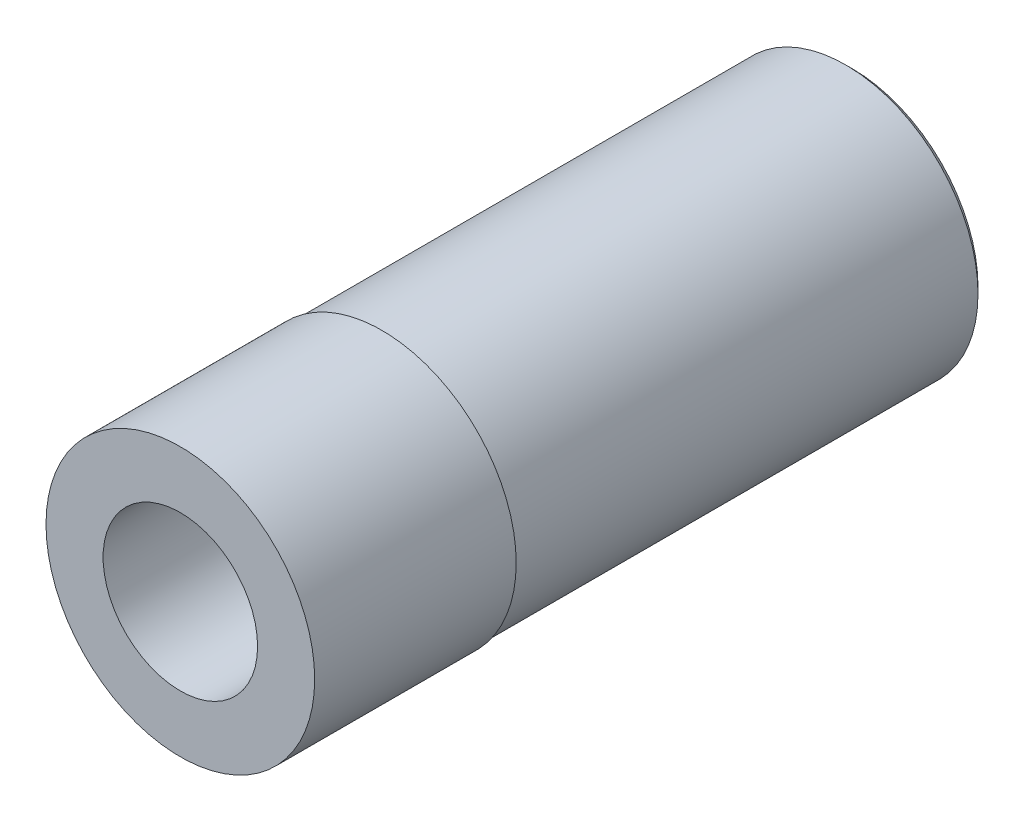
ISO-10303-21;
HEADER;
FILE_DESCRIPTION(('STEP AP214'),'2;1');
FILE_NAME('part.step','',(''),(''),'','','');
FILE_SCHEMA(('AUTOMOTIVE_DESIGN { 1 0 10303 214 1 1 1 1 }'));
ENDSEC;
DATA;
#1=APPLICATION_CONTEXT('core data for automotive mechanical design processes');
#2=APPLICATION_PROTOCOL_DEFINITION('international standard','automotive_design',2000,#1);
#3=PRODUCT_CONTEXT('',#1,'mechanical');
#4=PRODUCT('Part','Part','',(#3));
#5=PRODUCT_RELATED_PRODUCT_CATEGORY('part','',(#4));
#6=PRODUCT_DEFINITION_FORMATION('','',#4);
#7=PRODUCT_DEFINITION_CONTEXT('part definition',#1,'design');
#8=PRODUCT_DEFINITION('design','',#6,#7);
#9=PRODUCT_DEFINITION_SHAPE('','',#8);
#10=(LENGTH_UNIT() NAMED_UNIT(*) SI_UNIT(.MILLI.,.METRE.));
#11=(NAMED_UNIT(*) PLANE_ANGLE_UNIT() SI_UNIT($,.RADIAN.));
#12=(NAMED_UNIT(*) SI_UNIT($,.STERADIAN.) SOLID_ANGLE_UNIT());
#13=UNCERTAINTY_MEASURE_WITH_UNIT(LENGTH_MEASURE(1.E-05),#10,'distance_accuracy_value','');
#14=(GEOMETRIC_REPRESENTATION_CONTEXT(3) GLOBAL_UNCERTAINTY_ASSIGNED_CONTEXT((#13)) GLOBAL_UNIT_ASSIGNED_CONTEXT((#10,
#11,#12)) REPRESENTATION_CONTEXT('',''));
#15=CARTESIAN_POINT('',(0.,0.,0.));
#16=DIRECTION('',(0.,0.,1.));
#17=DIRECTION('',(1.,0.,0.));
#18=AXIS2_PLACEMENT_3D('',#15,#16,#17);
#19=CARTESIAN_POINT('',(0.,0.,3.79790950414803));
#20=DIRECTION('',(0.,0.,1.));
#21=DIRECTION('',(1.,0.,0.));
#22=AXIS2_PLACEMENT_3D('',#19,#20,#21);
#23=CYLINDRICAL_SURFACE('',#22,1.25);
#24=CARTESIAN_POINT('',(0.,0.,-16.));
#25=DIRECTION('',(0.,0.,1.));
#26=DIRECTION('',(1.,0.,0.));
#27=AXIS2_PLACEMENT_3D('',#24,#25,#26);
#28=CIRCLE('',#27,1.25);
#29=CARTESIAN_POINT('',(1.25,0.,-16.));
#30=VERTEX_POINT('',#29);
#31=EDGE_CURVE('E185',#30,#30,#28,.T.);
#32=ORIENTED_EDGE('',*,*,#31,.F.);
#33=EDGE_LOOP('',(#32));
#34=FACE_BOUND('',#33,.T.);
#35=CARTESIAN_POINT('',(0.,0.,-6.));
#36=DIRECTION('',(0.,0.,1.));
#37=DIRECTION('',(1.,0.,0.));
#38=AXIS2_PLACEMENT_3D('',#35,#36,#37);
#39=CIRCLE('',#38,1.25);
#40=CARTESIAN_POINT('',(1.08253175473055,-0.624999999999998,-6.));
#41=VERTEX_POINT('',#40);
#42=CARTESIAN_POINT('',(0.,-1.25,-6.));
#43=VERTEX_POINT('',#42);
#44=EDGE_CURVE('E11',#41,#43,#39,.F.);
#45=ORIENTED_EDGE('',*,*,#44,.F.);
#46=CARTESIAN_POINT('',(1.08253175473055,0.625,-6.));
#47=VERTEX_POINT('',#46);
#48=EDGE_CURVE('E38',#47,#41,#39,.F.);
#49=ORIENTED_EDGE('',*,*,#48,.F.);
#50=CARTESIAN_POINT('',(0.,1.25,-6.));
#51=VERTEX_POINT('',#50);
#52=EDGE_CURVE('E111',#51,#47,#39,.F.);
#53=ORIENTED_EDGE('',*,*,#52,.F.);
#54=CARTESIAN_POINT('',(-1.08253175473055,0.624999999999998,-6.));
#55=VERTEX_POINT('',#54);
#56=EDGE_CURVE('E296',#55,#51,#39,.F.);
#57=ORIENTED_EDGE('',*,*,#56,.F.);
#58=CARTESIAN_POINT('',(-1.08253175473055,-0.624999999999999,-6.));
#59=VERTEX_POINT('',#58);
#60=EDGE_CURVE('E294',#59,#55,#39,.F.);
#61=ORIENTED_EDGE('',*,*,#60,.F.);
#62=EDGE_CURVE('E43',#43,#59,#39,.F.);
#63=ORIENTED_EDGE('',*,*,#62,.F.);
#64=EDGE_LOOP('',(#45,#49,#53,#57,#61,#63));
#65=FACE_BOUND('',#64,.T.);
#66=ADVANCED_FACE('F34',(#34,#65),#23,.F.);
#67=CARTESIAN_POINT('',(0.,0.,3.79790950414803));
#68=DIRECTION('',(0.,0.,1.));
#69=DIRECTION('',(1.,0.,0.));
#70=AXIS2_PLACEMENT_3D('',#67,#68,#69);
#71=CYLINDRICAL_SURFACE('',#70,4.);
#72=CARTESIAN_POINT('',(0.,0.,0.));
#73=DIRECTION('',(0.,0.,1.));
#74=DIRECTION('',(1.,0.,0.));
#75=AXIS2_PLACEMENT_3D('',#72,#73,#74);
#76=CIRCLE('',#75,4.);
#77=CARTESIAN_POINT('',(4.,0.,0.));
#78=VERTEX_POINT('',#77);
#79=EDGE_CURVE('E194',#78,#78,#76,.T.);
#80=ORIENTED_EDGE('',*,*,#79,.F.);
#81=EDGE_LOOP('',(#80));
#82=FACE_BOUND('',#81,.T.);
#83=CARTESIAN_POINT('',(0.,0.,-6.));
#84=DIRECTION('',(0.,0.,-1.));
#85=DIRECTION('',(-1.,0.,0.));
#86=AXIS2_PLACEMENT_3D('',#83,#84,#85);
#87=CIRCLE('',#86,4.);
#88=CARTESIAN_POINT('',(-4.,0.,-6.));
#89=VERTEX_POINT('',#88);
#90=EDGE_CURVE('E179',#89,#89,#87,.T.);
#91=ORIENTED_EDGE('',*,*,#90,.F.);
#92=EDGE_LOOP('',(#91));
#93=FACE_BOUND('',#92,.T.);
#94=ADVANCED_FACE('F36',(#82,#93),#71,.T.);
#95=CARTESIAN_POINT('',(0.,0.,-20.));
#96=DIRECTION('',(0.,0.,1.));
#97=DIRECTION('',(1.,0.,0.));
#98=AXIS2_PLACEMENT_3D('',#95,#96,#97);
#99=CONICAL_SURFACE('',#98,3.7499999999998,0.785398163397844);
#100=CARTESIAN_POINT('',(0.,0.,-20.));
#101=DIRECTION('',(0.,0.,1.));
#102=DIRECTION('',(1.,0.,0.));
#103=AXIS2_PLACEMENT_3D('',#100,#101,#102);
#104=CIRCLE('',#103,3.7499999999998);
#105=CARTESIAN_POINT('',(3.7499999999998,0.,-20.));
#106=VERTEX_POINT('',#105);
#107=EDGE_CURVE('E175',#106,#106,#104,.T.);
#108=ORIENTED_EDGE('',*,*,#107,.T.);
#109=EDGE_LOOP('',(#108));
#110=FACE_BOUND('',#109,.T.);
#111=CARTESIAN_POINT('',(0.,0.,-19.815));
#112=DIRECTION('',(0.,0.,1.));
#113=DIRECTION('',(1.,0.,0.));
#114=AXIS2_PLACEMENT_3D('',#111,#112,#113);
#115=CIRCLE('',#114,3.935);
#116=CARTESIAN_POINT('',(3.935,0.,-19.815));
#117=VERTEX_POINT('',#116);
#118=EDGE_CURVE('E174',#117,#117,#115,.T.);
#119=ORIENTED_EDGE('',*,*,#118,.F.);
#120=EDGE_LOOP('',(#119));
#121=FACE_BOUND('',#120,.T.);
#122=ADVANCED_FACE('F204',(#110,#121),#99,.T.);
#123=CARTESIAN_POINT('',(0.,4.,0.));
#124=DIRECTION('',(0.,0.,-1.));
#125=DIRECTION('',(-1.,0.,0.));
#126=AXIS2_PLACEMENT_3D('',#123,#124,#125);
#127=PLANE('',#126);
#128=CARTESIAN_POINT('',(0.,0.,0.));
#129=DIRECTION('',(0.,0.,1.));
#130=DIRECTION('',(1.,0.,0.));
#131=AXIS2_PLACEMENT_3D('',#128,#129,#130);
#132=CIRCLE('',#131,2.3);
#133=CARTESIAN_POINT('',(2.3,0.,0.));
#134=VERTEX_POINT('',#133);
#135=EDGE_CURVE('E191',#134,#134,#132,.T.);
#136=ORIENTED_EDGE('',*,*,#135,.F.);
#137=EDGE_LOOP('',(#136));
#138=FACE_BOUND('',#137,.T.);
#139=ORIENTED_EDGE('',*,*,#79,.T.);
#140=EDGE_LOOP('',(#139));
#141=FACE_BOUND('',#140,.T.);
#142=ADVANCED_FACE('F210',(#138,#141),#127,.F.);
#143=CARTESIAN_POINT('',(0.,0.,3.79790950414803));
#144=DIRECTION('',(0.,0.,1.));
#145=DIRECTION('',(1.,0.,0.));
#146=AXIS2_PLACEMENT_3D('',#143,#144,#145);
#147=CYLINDRICAL_SURFACE('',#146,2.3);
#148=CARTESIAN_POINT('',(0.,0.,-4.));
#149=DIRECTION('',(0.,0.,1.));
#150=DIRECTION('',(1.,0.,0.));
#151=AXIS2_PLACEMENT_3D('',#148,#149,#150);
#152=CIRCLE('',#151,2.3);
#153=CARTESIAN_POINT('',(2.3,0.,-4.));
#154=VERTEX_POINT('',#153);
#155=EDGE_CURVE('E188',#154,#154,#152,.T.);
#156=ORIENTED_EDGE('',*,*,#155,.F.);
#157=EDGE_LOOP('',(#156));
#158=FACE_BOUND('',#157,.T.);
#159=ORIENTED_EDGE('',*,*,#135,.T.);
#160=EDGE_LOOP('',(#159));
#161=FACE_BOUND('',#160,.T.);
#162=ADVANCED_FACE('F218',(#158,#161),#147,.F.);
#163=CARTESIAN_POINT('',(0.,2.3,-4.));
#164=DIRECTION('',(0.,0.,-1.));
#165=DIRECTION('',(-1.,0.,0.));
#166=AXIS2_PLACEMENT_3D('',#163,#164,#165);
#167=PLANE('',#166);
#168=DIRECTION('',(-1.,0.,0.));
#169=VECTOR('',#168,1.);
#170=CARTESIAN_POINT('',(0.721687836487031,1.25,-4.));
#171=LINE('',#170,#169);
#172=CARTESIAN_POINT('',(0.721687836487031,1.25,-4.));
#173=VERTEX_POINT('',#172);
#174=CARTESIAN_POINT('',(-0.721687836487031,1.25,-4.));
#175=VERTEX_POINT('',#174);
#176=EDGE_CURVE('E50',#173,#175,#171,.T.);
#177=ORIENTED_EDGE('',*,*,#176,.F.);
#178=DIRECTION('',(-0.5,0.866025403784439,0.));
#179=VECTOR('',#178,1.);
#180=CARTESIAN_POINT('',(1.44337567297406,0.,-4.));
#181=LINE('',#180,#179);
#182=CARTESIAN_POINT('',(1.44337567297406,0.,-4.));
#183=VERTEX_POINT('',#182);
#184=EDGE_CURVE('E120',#183,#173,#181,.T.);
#185=ORIENTED_EDGE('',*,*,#184,.F.);
#186=DIRECTION('',(0.5,0.866025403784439,0.));
#187=VECTOR('',#186,1.);
#188=CARTESIAN_POINT('',(0.721687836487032,-1.25,-4.));
#189=LINE('',#188,#187);
#190=CARTESIAN_POINT('',(0.721687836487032,-1.25,-4.));
#191=VERTEX_POINT('',#190);
#192=EDGE_CURVE('E114',#191,#183,#189,.T.);
#193=ORIENTED_EDGE('',*,*,#192,.F.);
#194=DIRECTION('',(1.,0.,0.));
#195=VECTOR('',#194,1.);
#196=CARTESIAN_POINT('',(-0.72168783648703,-1.25,-4.));
#197=LINE('',#196,#195);
#198=CARTESIAN_POINT('',(-0.72168783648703,-1.25,-4.));
#199=VERTEX_POINT('',#198);
#200=EDGE_CURVE('E154',#199,#191,#197,.T.);
#201=ORIENTED_EDGE('',*,*,#200,.F.);
#202=DIRECTION('',(0.5,-0.866025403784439,0.));
#203=VECTOR('',#202,1.);
#204=CARTESIAN_POINT('',(-1.44337567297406,0.,-4.));
#205=LINE('',#204,#203);
#206=CARTESIAN_POINT('',(-1.44337567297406,0.,-4.));
#207=VERTEX_POINT('',#206);
#208=EDGE_CURVE('E151',#207,#199,#205,.T.);
#209=ORIENTED_EDGE('',*,*,#208,.F.);
#210=DIRECTION('',(-0.5,-0.866025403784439,0.));
#211=VECTOR('',#210,1.);
#212=CARTESIAN_POINT('',(-0.721687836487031,1.25,-4.));
#213=LINE('',#212,#211);
#214=EDGE_CURVE('E148',#175,#207,#213,.T.);
#215=ORIENTED_EDGE('',*,*,#214,.F.);
#216=EDGE_LOOP('',(#177,#185,#193,#201,#209,#215));
#217=FACE_BOUND('',#216,.T.);
#218=ORIENTED_EDGE('',*,*,#155,.T.);
#219=EDGE_LOOP('',(#218));
#220=FACE_BOUND('',#219,.T.);
#221=ADVANCED_FACE('F223',(#217,#220),#167,.F.);
#222=CARTESIAN_POINT('',(0.,1.25,-16.));
#223=DIRECTION('',(0.,0.,1.));
#224=DIRECTION('',(1.,0.,0.));
#225=AXIS2_PLACEMENT_3D('',#222,#223,#224);
#226=PLANE('',#225);
#227=CARTESIAN_POINT('',(0.,0.,-16.));
#228=DIRECTION('',(0.,0.,1.));
#229=DIRECTION('',(1.,0.,0.));
#230=AXIS2_PLACEMENT_3D('',#227,#228,#229);
#231=CIRCLE('',#230,2.);
#232=CARTESIAN_POINT('',(2.,0.,-16.));
#233=VERTEX_POINT('',#232);
#234=EDGE_CURVE('E182',#233,#233,#231,.T.);
#235=ORIENTED_EDGE('',*,*,#234,.F.);
#236=EDGE_LOOP('',(#235));
#237=FACE_BOUND('',#236,.T.);
#238=ORIENTED_EDGE('',*,*,#31,.T.);
#239=EDGE_LOOP('',(#238));
#240=FACE_BOUND('',#239,.T.);
#241=ADVANCED_FACE('F229',(#237,#240),#226,.F.);
#242=CARTESIAN_POINT('',(0.,0.,3.79790950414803));
#243=DIRECTION('',(0.,0.,1.));
#244=DIRECTION('',(1.,0.,0.));
#245=AXIS2_PLACEMENT_3D('',#242,#243,#244);
#246=CYLINDRICAL_SURFACE('',#245,2.);
#247=CARTESIAN_POINT('',(0.,0.,-20.));
#248=DIRECTION('',(0.,0.,1.));
#249=DIRECTION('',(1.,0.,0.));
#250=AXIS2_PLACEMENT_3D('',#247,#248,#249);
#251=CIRCLE('',#250,2.);
#252=CARTESIAN_POINT('',(2.,0.,-20.));
#253=VERTEX_POINT('',#252);
#254=EDGE_CURVE('E178',#253,#253,#251,.T.);
#255=ORIENTED_EDGE('',*,*,#254,.F.);
#256=EDGE_LOOP('',(#255));
#257=FACE_BOUND('',#256,.T.);
#258=ORIENTED_EDGE('',*,*,#234,.T.);
#259=EDGE_LOOP('',(#258));
#260=FACE_BOUND('',#259,.T.);
#261=ADVANCED_FACE('F233',(#257,#260),#246,.F.);
#262=CARTESIAN_POINT('',(0.,2.,-20.));
#263=DIRECTION('',(0.,0.,1.));
#264=DIRECTION('',(1.,0.,0.));
#265=AXIS2_PLACEMENT_3D('',#262,#263,#264);
#266=PLANE('',#265);
#267=ORIENTED_EDGE('',*,*,#107,.F.);
#268=EDGE_LOOP('',(#267));
#269=FACE_BOUND('',#268,.T.);
#270=ORIENTED_EDGE('',*,*,#254,.T.);
#271=EDGE_LOOP('',(#270));
#272=FACE_BOUND('',#271,.T.);
#273=ADVANCED_FACE('F237',(#269,#272),#266,.F.);
#274=CARTESIAN_POINT('',(0.,4.935,-6.));
#275=DIRECTION('',(0.,0.,-1.));
#276=DIRECTION('',(-1.,0.,0.));
#277=AXIS2_PLACEMENT_3D('',#274,#275,#276);
#278=PLANE('',#277);
#279=CARTESIAN_POINT('',(0.,0.,-6.));
#280=DIRECTION('',(0.,0.,1.));
#281=DIRECTION('',(1.,0.,0.));
#282=AXIS2_PLACEMENT_3D('',#279,#280,#281);
#283=CIRCLE('',#282,3.935);
#284=CARTESIAN_POINT('',(3.935,0.,-6.));
#285=VERTEX_POINT('',#284);
#286=EDGE_CURVE('E160',#285,#285,#283,.T.);
#287=ORIENTED_EDGE('',*,*,#286,.T.);
#288=EDGE_LOOP('',(#287));
#289=FACE_BOUND('',#288,.T.);
#290=ORIENTED_EDGE('',*,*,#90,.T.);
#291=EDGE_LOOP('',(#290));
#292=FACE_BOUND('',#291,.T.);
#293=ADVANCED_FACE('F201',(#289,#292),#278,.T.);
#294=CARTESIAN_POINT('',(0.,0.,0.));
#295=DIRECTION('',(0.,0.,1.));
#296=DIRECTION('',(1.,0.,0.));
#297=AXIS2_PLACEMENT_3D('',#294,#295,#296);
#298=CYLINDRICAL_SURFACE('',#297,3.935);
#299=ORIENTED_EDGE('',*,*,#286,.F.);
#300=EDGE_LOOP('',(#299));
#301=FACE_BOUND('',#300,.T.);
#302=ORIENTED_EDGE('',*,*,#118,.T.);
#303=EDGE_LOOP('',(#302));
#304=FACE_BOUND('',#303,.T.);
#305=ADVANCED_FACE('F244',(#301,#304),#298,.T.);
#306=CARTESIAN_POINT('',(1.44337567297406,0.,-6.));
#307=DIRECTION('',(0.866025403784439,0.5,0.));
#308=DIRECTION('',(-0.5,0.866025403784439,0.));
#309=AXIS2_PLACEMENT_3D('',#306,#307,#308);
#310=PLANE('',#309);
#311=ORIENTED_EDGE('',*,*,#184,.T.);
#312=DIRECTION('',(0.,0.,1.));
#313=VECTOR('',#312,1.);
#314=CARTESIAN_POINT('',(0.721687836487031,1.25,-6.));
#315=LINE('',#314,#313);
#316=CARTESIAN_POINT('',(0.721687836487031,1.25,-6.));
#317=VERTEX_POINT('',#316);
#318=EDGE_CURVE('E117',#317,#173,#315,.T.);
#319=ORIENTED_EDGE('',*,*,#318,.F.);
#320=DIRECTION('',(-0.5,0.866025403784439,0.));
#321=VECTOR('',#320,1.);
#322=CARTESIAN_POINT('',(1.44337567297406,0.,-6.));
#323=LINE('',#322,#321);
#324=EDGE_CURVE('E105',#47,#317,#323,.T.);
#325=ORIENTED_EDGE('',*,*,#324,.F.);
#326=CARTESIAN_POINT('',(1.44337567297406,0.,-6.));
#327=VERTEX_POINT('',#326);
#328=EDGE_CURVE('E58',#327,#47,#323,.T.);
#329=ORIENTED_EDGE('',*,*,#328,.F.);
#330=DIRECTION('',(0.,0.,1.));
#331=VECTOR('',#330,1.);
#332=CARTESIAN_POINT('',(1.44337567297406,0.,-6.));
#333=LINE('',#332,#331);
#334=EDGE_CURVE('E158',#327,#183,#333,.T.);
#335=ORIENTED_EDGE('',*,*,#334,.T.);
#336=EDGE_LOOP('',(#311,#319,#325,#329,#335));
#337=FACE_BOUND('',#336,.T.);
#338=ADVANCED_FACE('F118',(#337),#310,.F.);
#339=CARTESIAN_POINT('',(0.721687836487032,-1.25,-6.));
#340=DIRECTION('',(0.866025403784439,-0.499999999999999,0.));
#341=DIRECTION('',(0.499999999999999,0.866025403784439,0.));
#342=AXIS2_PLACEMENT_3D('',#339,#340,#341);
#343=PLANE('',#342);
#344=ORIENTED_EDGE('',*,*,#192,.T.);
#345=ORIENTED_EDGE('',*,*,#334,.F.);
#346=DIRECTION('',(0.5,0.866025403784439,0.));
#347=VECTOR('',#346,1.);
#348=CARTESIAN_POINT('',(0.721687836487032,-1.25,-6.));
#349=LINE('',#348,#347);
#350=EDGE_CURVE('E143',#41,#327,#349,.T.);
#351=ORIENTED_EDGE('',*,*,#350,.F.);
#352=CARTESIAN_POINT('',(0.721687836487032,-1.25,-6.));
#353=VERTEX_POINT('',#352);
#354=EDGE_CURVE('E123',#353,#41,#349,.T.);
#355=ORIENTED_EDGE('',*,*,#354,.F.);
#356=DIRECTION('',(0.,0.,1.));
#357=VECTOR('',#356,1.);
#358=CARTESIAN_POINT('',(0.721687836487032,-1.25,-6.));
#359=LINE('',#358,#357);
#360=EDGE_CURVE('E161',#353,#191,#359,.T.);
#361=ORIENTED_EDGE('',*,*,#360,.T.);
#362=EDGE_LOOP('',(#344,#345,#351,#355,#361));
#363=FACE_BOUND('',#362,.T.);
#364=ADVANCED_FACE('F251',(#363),#343,.F.);
#365=CARTESIAN_POINT('',(-0.72168783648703,-1.25,-6.));
#366=DIRECTION('',(0.,-1.,0.));
#367=DIRECTION('',(0.,0.,-1.));
#368=AXIS2_PLACEMENT_3D('',#365,#366,#367);
#369=PLANE('',#368);
#370=ORIENTED_EDGE('',*,*,#200,.T.);
#371=ORIENTED_EDGE('',*,*,#360,.F.);
#372=DIRECTION('',(1.,0.,0.));
#373=VECTOR('',#372,1.);
#374=CARTESIAN_POINT('',(-0.72168783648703,-1.25,-6.));
#375=LINE('',#374,#373);
#376=EDGE_CURVE('E139',#43,#353,#375,.T.);
#377=ORIENTED_EDGE('',*,*,#376,.F.);
#378=CARTESIAN_POINT('',(-0.72168783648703,-1.25,-6.));
#379=VERTEX_POINT('',#378);
#380=EDGE_CURVE('E140',#379,#43,#375,.T.);
#381=ORIENTED_EDGE('',*,*,#380,.F.);
#382=DIRECTION('',(0.,0.,1.));
#383=VECTOR('',#382,1.);
#384=CARTESIAN_POINT('',(-0.72168783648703,-1.25,-6.));
#385=LINE('',#384,#383);
#386=EDGE_CURVE('E164',#379,#199,#385,.T.);
#387=ORIENTED_EDGE('',*,*,#386,.T.);
#388=EDGE_LOOP('',(#370,#371,#377,#381,#387));
#389=FACE_BOUND('',#388,.T.);
#390=ADVANCED_FACE('F262',(#389),#369,.F.);
#391=CARTESIAN_POINT('',(-1.44337567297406,0.,-6.));
#392=DIRECTION('',(-0.866025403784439,-0.5,0.));
#393=DIRECTION('',(0.5,-0.866025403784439,0.));
#394=AXIS2_PLACEMENT_3D('',#391,#392,#393);
#395=PLANE('',#394);
#396=ORIENTED_EDGE('',*,*,#208,.T.);
#397=ORIENTED_EDGE('',*,*,#386,.F.);
#398=DIRECTION('',(0.5,-0.866025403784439,0.));
#399=VECTOR('',#398,1.);
#400=CARTESIAN_POINT('',(-1.44337567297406,0.,-6.));
#401=LINE('',#400,#399);
#402=EDGE_CURVE('E135',#59,#379,#401,.T.);
#403=ORIENTED_EDGE('',*,*,#402,.F.);
#404=CARTESIAN_POINT('',(-1.44337567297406,0.,-6.));
#405=VERTEX_POINT('',#404);
#406=EDGE_CURVE('E136',#405,#59,#401,.T.);
#407=ORIENTED_EDGE('',*,*,#406,.F.);
#408=DIRECTION('',(0.,0.,1.));
#409=VECTOR('',#408,1.);
#410=CARTESIAN_POINT('',(-1.44337567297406,0.,-6.));
#411=LINE('',#410,#409);
#412=EDGE_CURVE('E167',#405,#207,#411,.T.);
#413=ORIENTED_EDGE('',*,*,#412,.T.);
#414=EDGE_LOOP('',(#396,#397,#403,#407,#413));
#415=FACE_BOUND('',#414,.T.);
#416=ADVANCED_FACE('F258',(#415),#395,.F.);
#417=CARTESIAN_POINT('',(-0.721687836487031,1.25,-6.));
#418=DIRECTION('',(-0.866025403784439,0.5,0.));
#419=DIRECTION('',(-0.5,-0.866025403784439,0.));
#420=AXIS2_PLACEMENT_3D('',#417,#418,#419);
#421=PLANE('',#420);
#422=ORIENTED_EDGE('',*,*,#214,.T.);
#423=ORIENTED_EDGE('',*,*,#412,.F.);
#424=DIRECTION('',(-0.5,-0.866025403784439,0.));
#425=VECTOR('',#424,1.);
#426=CARTESIAN_POINT('',(-0.721687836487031,1.25,-6.));
#427=LINE('',#426,#425);
#428=EDGE_CURVE('E129',#55,#405,#427,.T.);
#429=ORIENTED_EDGE('',*,*,#428,.F.);
#430=CARTESIAN_POINT('',(-0.721687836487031,1.25,-6.));
#431=VERTEX_POINT('',#430);
#432=EDGE_CURVE('E131',#431,#55,#427,.T.);
#433=ORIENTED_EDGE('',*,*,#432,.F.);
#434=DIRECTION('',(0.,0.,1.));
#435=VECTOR('',#434,1.);
#436=CARTESIAN_POINT('',(-0.721687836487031,1.25,-6.));
#437=LINE('',#436,#435);
#438=EDGE_CURVE('E122',#431,#175,#437,.T.);
#439=ORIENTED_EDGE('',*,*,#438,.T.);
#440=EDGE_LOOP('',(#422,#423,#429,#433,#439));
#441=FACE_BOUND('',#440,.T.);
#442=ADVANCED_FACE('F255',(#441),#421,.F.);
#443=CARTESIAN_POINT('',(0.721687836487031,1.25,-6.));
#444=DIRECTION('',(0.,1.,0.));
#445=DIRECTION('',(-1.,0.,0.));
#446=AXIS2_PLACEMENT_3D('',#443,#444,#445);
#447=PLANE('',#446);
#448=ORIENTED_EDGE('',*,*,#176,.T.);
#449=ORIENTED_EDGE('',*,*,#438,.F.);
#450=DIRECTION('',(-1.,0.,0.));
#451=VECTOR('',#450,1.);
#452=CARTESIAN_POINT('',(0.721687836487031,1.25,-6.));
#453=LINE('',#452,#451);
#454=EDGE_CURVE('E128',#51,#431,#453,.T.);
#455=ORIENTED_EDGE('',*,*,#454,.F.);
#456=EDGE_CURVE('E109',#317,#51,#453,.T.);
#457=ORIENTED_EDGE('',*,*,#456,.F.);
#458=ORIENTED_EDGE('',*,*,#318,.T.);
#459=EDGE_LOOP('',(#448,#449,#455,#457,#458));
#460=FACE_BOUND('',#459,.T.);
#461=ADVANCED_FACE('F126',(#460),#447,.F.);
#462=CARTESIAN_POINT('',(0.721687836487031,1.25,-6.));
#463=DIRECTION('',(0.,0.,1.));
#464=DIRECTION('',(1.,0.,0.));
#465=AXIS2_PLACEMENT_3D('',#462,#463,#464);
#466=PLANE('',#465);
#467=ORIENTED_EDGE('',*,*,#44,.T.);
#468=ORIENTED_EDGE('',*,*,#376,.T.);
#469=ORIENTED_EDGE('',*,*,#354,.T.);
#470=EDGE_LOOP('',(#467,#468,#469));
#471=FACE_BOUND('',#470,.T.);
#472=ADVANCED_FACE('F254',(#471),#466,.T.);
#473=ORIENTED_EDGE('',*,*,#62,.T.);
#474=ORIENTED_EDGE('',*,*,#402,.T.);
#475=ORIENTED_EDGE('',*,*,#380,.T.);
#476=EDGE_LOOP('',(#473,#474,#475));
#477=FACE_BOUND('',#476,.T.);
#478=ADVANCED_FACE('F271',(#477),#466,.T.);
#479=ORIENTED_EDGE('',*,*,#60,.T.);
#480=ORIENTED_EDGE('',*,*,#428,.T.);
#481=ORIENTED_EDGE('',*,*,#406,.T.);
#482=EDGE_LOOP('',(#479,#480,#481));
#483=FACE_BOUND('',#482,.T.);
#484=ADVANCED_FACE('F277',(#483),#466,.T.);
#485=ORIENTED_EDGE('',*,*,#56,.T.);
#486=ORIENTED_EDGE('',*,*,#454,.T.);
#487=ORIENTED_EDGE('',*,*,#432,.T.);
#488=EDGE_LOOP('',(#485,#486,#487));
#489=FACE_BOUND('',#488,.T.);
#490=ADVANCED_FACE('F283',(#489),#466,.T.);
#491=ORIENTED_EDGE('',*,*,#52,.T.);
#492=ORIENTED_EDGE('',*,*,#324,.T.);
#493=ORIENTED_EDGE('',*,*,#456,.T.);
#494=EDGE_LOOP('',(#491,#492,#493));
#495=FACE_BOUND('',#494,.T.);
#496=ADVANCED_FACE('F107',(#495),#466,.T.);
#497=ORIENTED_EDGE('',*,*,#48,.T.);
#498=ORIENTED_EDGE('',*,*,#350,.T.);
#499=ORIENTED_EDGE('',*,*,#328,.T.);
#500=EDGE_LOOP('',(#497,#498,#499));
#501=FACE_BOUND('',#500,.T.);
#502=ADVANCED_FACE('F273',(#501),#466,.T.);
#503=CLOSED_SHELL('',(#66,#94,#122,#142,#162,#221,#241,#261,#273,#293,#305,#338,#364,#390,#416,
#442,#461,#472,#478,#484,#490,#496,#502));
#504=MANIFOLD_SOLID_BREP('B2',#503);
#505=ADVANCED_BREP_SHAPE_REPRESENTATION('',(#18,#504),#14);
#506=SHAPE_DEFINITION_REPRESENTATION(#9,#505);
ENDSEC;
END-ISO-10303-21;
